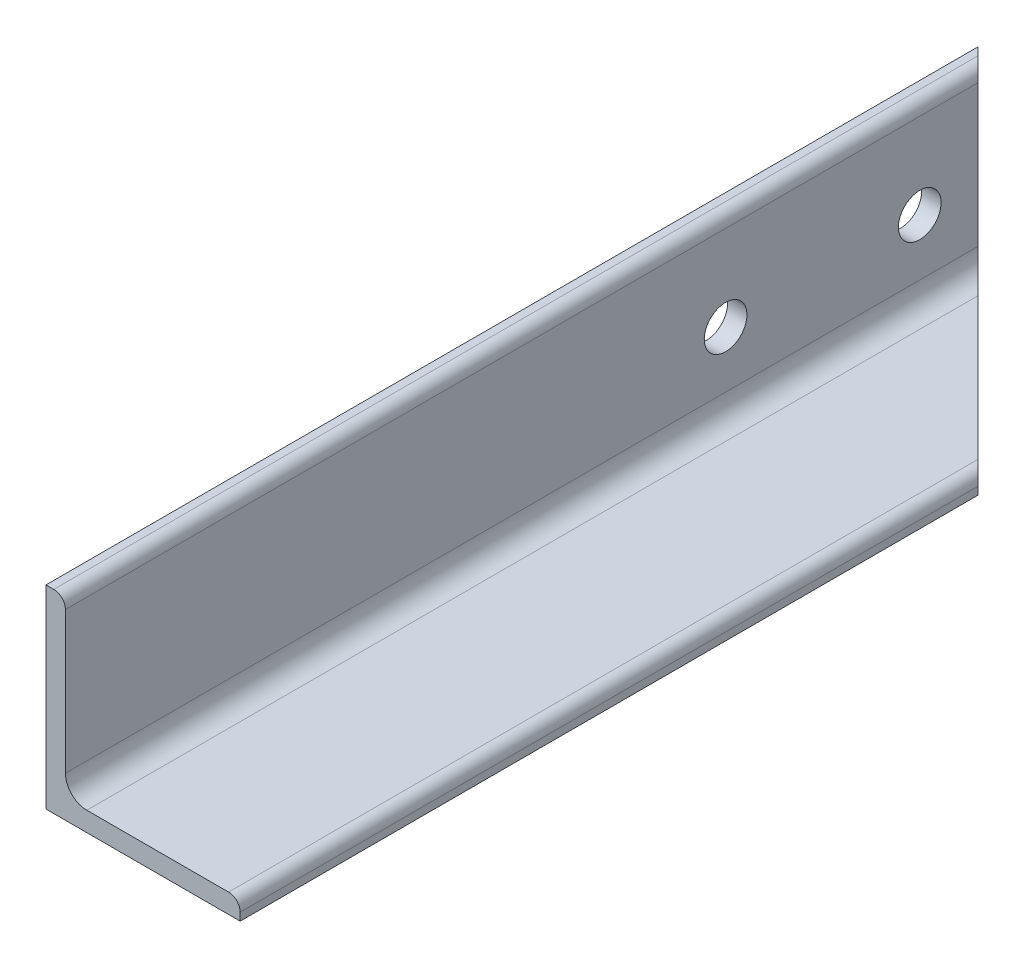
ISO-10303-21;
HEADER;
FILE_DESCRIPTION(('STEP AP214'),'2;1');
FILE_NAME('part.step','',(''),(''),'','','');
FILE_SCHEMA(('AUTOMOTIVE_DESIGN { 1 0 10303 214 1 1 1 1 }'));
ENDSEC;
DATA;
#1=APPLICATION_CONTEXT('core data for automotive mechanical design processes');
#2=APPLICATION_PROTOCOL_DEFINITION('international standard','automotive_design',2000,#1);
#3=PRODUCT_CONTEXT('',#1,'mechanical');
#4=PRODUCT('Part','Part','',(#3));
#5=PRODUCT_RELATED_PRODUCT_CATEGORY('part','',(#4));
#6=PRODUCT_DEFINITION_FORMATION('','',#4);
#7=PRODUCT_DEFINITION_CONTEXT('part definition',#1,'design');
#8=PRODUCT_DEFINITION('design','',#6,#7);
#9=PRODUCT_DEFINITION_SHAPE('','',#8);
#10=(LENGTH_UNIT() NAMED_UNIT(*) SI_UNIT(.MILLI.,.METRE.));
#11=(NAMED_UNIT(*) PLANE_ANGLE_UNIT() SI_UNIT($,.RADIAN.));
#12=(NAMED_UNIT(*) SI_UNIT($,.STERADIAN.) SOLID_ANGLE_UNIT());
#13=UNCERTAINTY_MEASURE_WITH_UNIT(LENGTH_MEASURE(1.E-05),#10,'distance_accuracy_value','');
#14=(GEOMETRIC_REPRESENTATION_CONTEXT(3) GLOBAL_UNCERTAINTY_ASSIGNED_CONTEXT((#13)) GLOBAL_UNIT_ASSIGNED_CONTEXT((#10,
#11,#12)) REPRESENTATION_CONTEXT('',''));
#15=CARTESIAN_POINT('',(0.,0.,0.));
#16=DIRECTION('',(0.,0.,1.));
#17=DIRECTION('',(1.,0.,0.));
#18=AXIS2_PLACEMENT_3D('',#15,#16,#17);
#19=CARTESIAN_POINT('',(1.99999999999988,49.9999999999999,240.));
#20=DIRECTION('',(0.,-1.,0.));
#21=DIRECTION('',(0.,0.,-1.));
#22=AXIS2_PLACEMENT_3D('',#19,#20,#21);
#23=PLANE('',#22);
#24=DIRECTION('',(0.,0.,-1.));
#25=VECTOR('',#24,1.);
#26=CARTESIAN_POINT('',(1.99999999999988,49.9999999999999,240.));
#27=LINE('',#26,#25);
#28=CARTESIAN_POINT('',(1.99999999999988,49.9999999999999,240.));
#29=VERTEX_POINT('',#28);
#30=CARTESIAN_POINT('',(1.99999999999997,50.,2.));
#31=VERTEX_POINT('',#30);
#32=EDGE_CURVE('E173',#29,#31,#27,.T.);
#33=ORIENTED_EDGE('',*,*,#32,.T.);
#34=DIRECTION('',(-0.707106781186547,0.,-0.707106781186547));
#35=VECTOR('',#34,1.);
#36=CARTESIAN_POINT('',(121.,49.9999999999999,121.));
#37=LINE('',#36,#35);
#38=CARTESIAN_POINT('',(0.,50.,0.));
#39=VERTEX_POINT('',#38);
#40=EDGE_CURVE('E195',#31,#39,#37,.T.);
#41=ORIENTED_EDGE('',*,*,#40,.T.);
#42=DIRECTION('',(0.,0.,-1.));
#43=VECTOR('',#42,1.);
#44=CARTESIAN_POINT('',(-1.00613961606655E-13,49.9999999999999,240.));
#45=LINE('',#44,#43);
#46=CARTESIAN_POINT('',(-1.00613961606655E-13,49.9999999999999,240.));
#47=VERTEX_POINT('',#46);
#48=EDGE_CURVE('E11',#47,#39,#45,.T.);
#49=ORIENTED_EDGE('',*,*,#48,.F.);
#50=DIRECTION('',(-1.,0.,0.));
#51=VECTOR('',#50,1.);
#52=CARTESIAN_POINT('',(1.99999999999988,49.9999999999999,240.));
#53=LINE('',#52,#51);
#54=EDGE_CURVE('E148',#29,#47,#53,.T.);
#55=ORIENTED_EDGE('',*,*,#54,.F.);
#56=EDGE_LOOP('',(#33,#41,#49,#55));
#57=FACE_BOUND('',#56,.T.);
#58=ADVANCED_FACE('F41',(#57),#23,.F.);
#59=CARTESIAN_POINT('',(-1.00613961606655E-13,49.9999999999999,240.));
#60=DIRECTION('',(1.,0.,0.));
#61=DIRECTION('',(0.,1.,0.));
#62=AXIS2_PLACEMENT_3D('',#59,#60,#61);
#63=PLANE('',#62);
#64=CARTESIAN_POINT('',(0.,24.9999999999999,70.0000000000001));
#65=DIRECTION('',(-1.,0.,0.));
#66=DIRECTION('',(0.,-1.,0.));
#67=AXIS2_PLACEMENT_3D('',#64,#65,#66);
#68=CIRCLE('',#67,5.5);
#69=CARTESIAN_POINT('',(0.,19.4999999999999,70.0000000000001));
#70=VERTEX_POINT('',#69);
#71=EDGE_CURVE('E155',#70,#70,#68,.T.);
#72=ORIENTED_EDGE('',*,*,#71,.F.);
#73=EDGE_LOOP('',(#72));
#74=FACE_BOUND('',#73,.T.);
#75=CARTESIAN_POINT('',(0.,24.9999999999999,20.));
#76=DIRECTION('',(-1.,0.,0.));
#77=DIRECTION('',(0.,-1.,0.));
#78=AXIS2_PLACEMENT_3D('',#75,#76,#77);
#79=CIRCLE('',#78,5.5);
#80=CARTESIAN_POINT('',(0.,19.4999999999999,20.));
#81=VERTEX_POINT('',#80);
#82=EDGE_CURVE('E145',#81,#81,#79,.T.);
#83=ORIENTED_EDGE('',*,*,#82,.F.);
#84=EDGE_LOOP('',(#83));
#85=FACE_BOUND('',#84,.T.);
#86=DIRECTION('',(0.,-1.,0.));
#87=VECTOR('',#86,1.);
#88=CARTESIAN_POINT('',(0.,50.,0.));
#89=LINE('',#88,#87);
#90=CARTESIAN_POINT('',(0.,0.,0.));
#91=VERTEX_POINT('',#90);
#92=EDGE_CURVE('E144',#39,#91,#89,.T.);
#93=ORIENTED_EDGE('',*,*,#92,.T.);
#94=DIRECTION('',(0.,0.,-1.));
#95=VECTOR('',#94,1.);
#96=CARTESIAN_POINT('',(0.,-1.11022302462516E-13,240.));
#97=LINE('',#96,#95);
#98=CARTESIAN_POINT('',(0.,-1.11022302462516E-13,240.));
#99=VERTEX_POINT('',#98);
#100=EDGE_CURVE('E49',#99,#91,#97,.T.);
#101=ORIENTED_EDGE('',*,*,#100,.F.);
#102=DIRECTION('',(0.,-1.,0.));
#103=VECTOR('',#102,1.);
#104=CARTESIAN_POINT('',(-1.00613961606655E-13,49.9999999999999,240.));
#105=LINE('',#104,#103);
#106=EDGE_CURVE('E160',#47,#99,#105,.T.);
#107=ORIENTED_EDGE('',*,*,#106,.F.);
#108=ORIENTED_EDGE('',*,*,#48,.T.);
#109=EDGE_LOOP('',(#93,#101,#107,#108));
#110=FACE_BOUND('',#109,.T.);
#111=ADVANCED_FACE('F214',(#74,#85,#110),#63,.F.);
#112=CARTESIAN_POINT('',(0.,-1.11022302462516E-13,240.));
#113=DIRECTION('',(0.,1.,0.));
#114=DIRECTION('',(0.,0.,1.));
#115=AXIS2_PLACEMENT_3D('',#112,#113,#114);
#116=PLANE('',#115);
#117=ORIENTED_EDGE('',*,*,#100,.T.);
#118=DIRECTION('',(-0.707106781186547,0.,-0.707106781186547));
#119=VECTOR('',#118,1.);
#120=CARTESIAN_POINT('',(49.9999999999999,0.,50.));
#121=LINE('',#120,#119);
#122=CARTESIAN_POINT('',(49.9999999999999,0.,50.));
#123=VERTEX_POINT('',#122);
#124=EDGE_CURVE('E115',#123,#91,#121,.T.);
#125=ORIENTED_EDGE('',*,*,#124,.F.);
#126=DIRECTION('',(0.,0.,-1.));
#127=VECTOR('',#126,1.);
#128=CARTESIAN_POINT('',(49.9999999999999,-1.11022302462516E-13,240.));
#129=LINE('',#128,#127);
#130=CARTESIAN_POINT('',(49.9999999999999,-1.11022302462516E-13,240.));
#131=VERTEX_POINT('',#130);
#132=EDGE_CURVE('E130',#131,#123,#129,.T.);
#133=ORIENTED_EDGE('',*,*,#132,.F.);
#134=DIRECTION('',(1.,0.,0.));
#135=VECTOR('',#134,1.);
#136=CARTESIAN_POINT('',(0.,-1.11022302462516E-13,240.));
#137=LINE('',#136,#135);
#138=EDGE_CURVE('E162',#99,#131,#137,.T.);
#139=ORIENTED_EDGE('',*,*,#138,.F.);
#140=EDGE_LOOP('',(#117,#125,#133,#139));
#141=FACE_BOUND('',#140,.T.);
#142=ADVANCED_FACE('F128',(#141),#116,.F.);
#143=CARTESIAN_POINT('',(49.9999999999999,-1.11022302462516E-13,240.));
#144=DIRECTION('',(-1.,0.,0.));
#145=DIRECTION('',(0.,0.,1.));
#146=AXIS2_PLACEMENT_3D('',#143,#144,#145);
#147=PLANE('',#146);
#148=ORIENTED_EDGE('',*,*,#132,.T.);
#149=DIRECTION('',(0.,-1.,0.));
#150=VECTOR('',#149,1.);
#151=CARTESIAN_POINT('',(49.9999999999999,240.,49.9999999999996));
#152=LINE('',#151,#150);
#153=CARTESIAN_POINT('',(49.9999999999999,1.99999999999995,50.));
#154=VERTEX_POINT('',#153);
#155=EDGE_CURVE('E112',#154,#123,#152,.T.);
#156=ORIENTED_EDGE('',*,*,#155,.F.);
#157=DIRECTION('',(0.,0.,-1.));
#158=VECTOR('',#157,1.);
#159=CARTESIAN_POINT('',(49.9999999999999,1.99999999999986,240.));
#160=LINE('',#159,#158);
#161=CARTESIAN_POINT('',(49.9999999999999,1.99999999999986,240.));
#162=VERTEX_POINT('',#161);
#163=EDGE_CURVE('E136',#162,#154,#160,.T.);
#164=ORIENTED_EDGE('',*,*,#163,.F.);
#165=DIRECTION('',(0.,1.,0.));
#166=VECTOR('',#165,1.);
#167=CARTESIAN_POINT('',(49.9999999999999,-1.11022302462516E-13,240.));
#168=LINE('',#167,#166);
#169=EDGE_CURVE('E135',#131,#162,#168,.T.);
#170=ORIENTED_EDGE('',*,*,#169,.F.);
#171=EDGE_LOOP('',(#148,#156,#164,#170));
#172=FACE_BOUND('',#171,.T.);
#173=ADVANCED_FACE('F134',(#172),#147,.F.);
#174=CARTESIAN_POINT('',(46.9999999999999,1.99999999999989,240.));
#175=DIRECTION('',(0.,0.,-1.));
#176=DIRECTION('',(-1.,0.,0.));
#177=AXIS2_PLACEMENT_3D('',#174,#175,#176);
#178=CYLINDRICAL_SURFACE('',#177,3.);
#179=ORIENTED_EDGE('',*,*,#163,.T.);
#180=CARTESIAN_POINT('',(47.,1.99999999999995,46.9999999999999));
#181=DIRECTION('',(-0.707106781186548,0.,0.707106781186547));
#182=DIRECTION('',(-0.707106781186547,0.,-0.707106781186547));
#183=AXIS2_PLACEMENT_3D('',#180,#181,#182);
#184=ELLIPSE('',#183,4.24264068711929,3.);
#185=CARTESIAN_POINT('',(47.,4.99999999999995,46.9999999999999));
#186=VERTEX_POINT('',#185);
#187=EDGE_CURVE('E118',#154,#186,#184,.T.);
#188=ORIENTED_EDGE('',*,*,#187,.T.);
#189=DIRECTION('',(0.,0.,-1.));
#190=VECTOR('',#189,1.);
#191=CARTESIAN_POINT('',(46.9999999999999,4.99999999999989,240.));
#192=LINE('',#191,#190);
#193=CARTESIAN_POINT('',(46.9999999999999,4.99999999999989,240.));
#194=VERTEX_POINT('',#193);
#195=EDGE_CURVE('E139',#194,#186,#192,.T.);
#196=ORIENTED_EDGE('',*,*,#195,.F.);
#197=CARTESIAN_POINT('',(46.9999999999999,1.99999999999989,240.));
#198=DIRECTION('',(0.,0.,1.));
#199=DIRECTION('',(1.,0.,0.));
#200=AXIS2_PLACEMENT_3D('',#197,#198,#199);
#201=CIRCLE('',#200,3.);
#202=EDGE_CURVE('E165',#162,#194,#201,.T.);
#203=ORIENTED_EDGE('',*,*,#202,.F.);
#204=EDGE_LOOP('',(#179,#188,#196,#203));
#205=FACE_BOUND('',#204,.T.);
#206=ADVANCED_FACE('F194',(#205),#178,.T.);
#207=CARTESIAN_POINT('',(46.9999999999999,4.99999999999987,240.));
#208=DIRECTION('',(0.,-1.,0.));
#209=DIRECTION('',(1.,0.,0.));
#210=AXIS2_PLACEMENT_3D('',#207,#208,#209);
#211=PLANE('',#210);
#212=ORIENTED_EDGE('',*,*,#195,.T.);
#213=DIRECTION('',(-0.707106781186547,0.,-0.707106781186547));
#214=VECTOR('',#213,1.);
#215=CARTESIAN_POINT('',(143.5,4.99999999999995,143.5));
#216=LINE('',#215,#214);
#217=CARTESIAN_POINT('',(10.5,5.,10.5));
#218=VERTEX_POINT('',#217);
#219=EDGE_CURVE('E191',#186,#218,#216,.T.);
#220=ORIENTED_EDGE('',*,*,#219,.T.);
#221=DIRECTION('',(0.,0.,-1.));
#222=VECTOR('',#221,1.);
#223=CARTESIAN_POINT('',(10.5,4.99999999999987,240.));
#224=LINE('',#223,#222);
#225=CARTESIAN_POINT('',(10.5,4.99999999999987,240.));
#226=VERTEX_POINT('',#225);
#227=EDGE_CURVE('E182',#226,#218,#224,.T.);
#228=ORIENTED_EDGE('',*,*,#227,.F.);
#229=DIRECTION('',(-1.,0.,0.));
#230=VECTOR('',#229,1.);
#231=CARTESIAN_POINT('',(46.9999999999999,4.99999999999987,240.));
#232=LINE('',#231,#230);
#233=EDGE_CURVE('E167',#194,#226,#232,.T.);
#234=ORIENTED_EDGE('',*,*,#233,.F.);
#235=EDGE_LOOP('',(#212,#220,#228,#234));
#236=FACE_BOUND('',#235,.T.);
#237=ADVANCED_FACE('F189',(#236),#211,.F.);
#238=CARTESIAN_POINT('',(10.4999999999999,10.4999999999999,240.));
#239=DIRECTION('',(0.,0.,-1.));
#240=DIRECTION('',(-1.,0.,0.));
#241=AXIS2_PLACEMENT_3D('',#238,#239,#240);
#242=CYLINDRICAL_SURFACE('',#241,5.5);
#243=ORIENTED_EDGE('',*,*,#227,.T.);
#244=CARTESIAN_POINT('',(10.5,10.5,10.5));
#245=DIRECTION('',(-0.707106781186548,0.,0.707106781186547));
#246=DIRECTION('',(-0.707106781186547,0.,-0.707106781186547));
#247=AXIS2_PLACEMENT_3D('',#244,#245,#246);
#248=ELLIPSE('',#247,7.77817459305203,5.5);
#249=CARTESIAN_POINT('',(5.,10.5,4.99999999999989));
#250=VERTEX_POINT('',#249);
#251=EDGE_CURVE('E198',#218,#250,#248,.F.);
#252=ORIENTED_EDGE('',*,*,#251,.T.);
#253=DIRECTION('',(0.,0.,-1.));
#254=VECTOR('',#253,1.);
#255=CARTESIAN_POINT('',(4.99999999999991,10.4999999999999,240.));
#256=LINE('',#255,#254);
#257=CARTESIAN_POINT('',(4.99999999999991,10.4999999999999,240.));
#258=VERTEX_POINT('',#257);
#259=EDGE_CURVE('E179',#258,#250,#256,.T.);
#260=ORIENTED_EDGE('',*,*,#259,.F.);
#261=CARTESIAN_POINT('',(10.4999999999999,10.4999999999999,240.));
#262=DIRECTION('',(0.,0.,-1.));
#263=DIRECTION('',(-1.,0.,0.));
#264=AXIS2_PLACEMENT_3D('',#261,#262,#263);
#265=CIRCLE('',#264,5.5);
#266=EDGE_CURVE('E169',#226,#258,#265,.T.);
#267=ORIENTED_EDGE('',*,*,#266,.F.);
#268=EDGE_LOOP('',(#243,#252,#260,#267));
#269=FACE_BOUND('',#268,.T.);
#270=ADVANCED_FACE('F231',(#269),#242,.F.);
#271=CARTESIAN_POINT('',(4.99999999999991,10.4999999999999,240.));
#272=DIRECTION('',(-1.,0.,0.));
#273=DIRECTION('',(0.,-1.,0.));
#274=AXIS2_PLACEMENT_3D('',#271,#272,#273);
#275=PLANE('',#274);
#276=CARTESIAN_POINT('',(4.99999999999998,24.9999999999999,70.0000000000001));
#277=DIRECTION('',(-1.,0.,0.));
#278=DIRECTION('',(0.,-1.,0.));
#279=AXIS2_PLACEMENT_3D('',#276,#277,#278);
#280=CIRCLE('',#279,5.5);
#281=CARTESIAN_POINT('',(4.99999999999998,19.4999999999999,70.0000000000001));
#282=VERTEX_POINT('',#281);
#283=EDGE_CURVE('E44',#282,#282,#280,.T.);
#284=ORIENTED_EDGE('',*,*,#283,.T.);
#285=EDGE_LOOP('',(#284));
#286=FACE_BOUND('',#285,.T.);
#287=CARTESIAN_POINT('',(4.99999999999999,24.9999999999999,20.));
#288=DIRECTION('',(-1.,0.,0.));
#289=DIRECTION('',(0.,-1.,0.));
#290=AXIS2_PLACEMENT_3D('',#287,#288,#289);
#291=CIRCLE('',#290,5.5);
#292=CARTESIAN_POINT('',(4.99999999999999,19.4999999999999,20.));
#293=VERTEX_POINT('',#292);
#294=EDGE_CURVE('E142',#293,#293,#291,.T.);
#295=ORIENTED_EDGE('',*,*,#294,.T.);
#296=EDGE_LOOP('',(#295));
#297=FACE_BOUND('',#296,.T.);
#298=ORIENTED_EDGE('',*,*,#259,.T.);
#299=DIRECTION('',(0.,1.,0.));
#300=VECTOR('',#299,1.);
#301=CARTESIAN_POINT('',(5.,10.5,4.99999999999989));
#302=LINE('',#301,#300);
#303=CARTESIAN_POINT('',(4.99999999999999,47.,4.99999999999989));
#304=VERTEX_POINT('',#303);
#305=EDGE_CURVE('E203',#250,#304,#302,.T.);
#306=ORIENTED_EDGE('',*,*,#305,.T.);
#307=DIRECTION('',(0.,0.,-1.));
#308=VECTOR('',#307,1.);
#309=CARTESIAN_POINT('',(4.99999999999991,46.9999999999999,240.));
#310=LINE('',#309,#308);
#311=CARTESIAN_POINT('',(4.99999999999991,46.9999999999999,240.));
#312=VERTEX_POINT('',#311);
#313=EDGE_CURVE('E176',#312,#304,#310,.T.);
#314=ORIENTED_EDGE('',*,*,#313,.F.);
#315=DIRECTION('',(0.,1.,0.));
#316=VECTOR('',#315,1.);
#317=CARTESIAN_POINT('',(4.99999999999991,10.4999999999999,240.));
#318=LINE('',#317,#316);
#319=EDGE_CURVE('E62',#258,#312,#318,.T.);
#320=ORIENTED_EDGE('',*,*,#319,.F.);
#321=EDGE_LOOP('',(#298,#306,#314,#320));
#322=FACE_BOUND('',#321,.T.);
#323=ADVANCED_FACE('F234',(#286,#297,#322),#275,.F.);
#324=CARTESIAN_POINT('',(1.9999999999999,46.9999999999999,240.));
#325=DIRECTION('',(0.,0.,-1.));
#326=DIRECTION('',(-1.,0.,0.));
#327=AXIS2_PLACEMENT_3D('',#324,#325,#326);
#328=CYLINDRICAL_SURFACE('',#327,3.);
#329=ORIENTED_EDGE('',*,*,#313,.T.);
#330=CARTESIAN_POINT('',(1.99999999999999,47.,2.));
#331=DIRECTION('',(-0.707106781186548,0.,0.707106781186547));
#332=DIRECTION('',(-0.707106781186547,0.,-0.707106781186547));
#333=AXIS2_PLACEMENT_3D('',#330,#331,#332);
#334=ELLIPSE('',#333,4.24264068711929,3.);
#335=EDGE_CURVE('E123',#304,#31,#334,.T.);
#336=ORIENTED_EDGE('',*,*,#335,.T.);
#337=ORIENTED_EDGE('',*,*,#32,.F.);
#338=CARTESIAN_POINT('',(1.9999999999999,46.9999999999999,240.));
#339=DIRECTION('',(0.,0.,1.));
#340=DIRECTION('',(1.,0.,0.));
#341=AXIS2_PLACEMENT_3D('',#338,#339,#340);
#342=CIRCLE('',#341,3.);
#343=EDGE_CURVE('E57',#312,#29,#342,.T.);
#344=ORIENTED_EDGE('',*,*,#343,.F.);
#345=EDGE_LOOP('',(#329,#336,#337,#344));
#346=FACE_BOUND('',#345,.T.);
#347=ADVANCED_FACE('F208',(#346),#328,.T.);
#348=CARTESIAN_POINT('',(46.9999999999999,1.99999999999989,240.));
#349=DIRECTION('',(0.,0.,1.));
#350=DIRECTION('',(1.,0.,0.));
#351=AXIS2_PLACEMENT_3D('',#348,#349,#350);
#352=PLANE('',#351);
#353=ORIENTED_EDGE('',*,*,#54,.T.);
#354=ORIENTED_EDGE('',*,*,#106,.T.);
#355=ORIENTED_EDGE('',*,*,#138,.T.);
#356=ORIENTED_EDGE('',*,*,#169,.T.);
#357=ORIENTED_EDGE('',*,*,#202,.T.);
#358=ORIENTED_EDGE('',*,*,#233,.T.);
#359=ORIENTED_EDGE('',*,*,#266,.T.);
#360=ORIENTED_EDGE('',*,*,#319,.T.);
#361=ORIENTED_EDGE('',*,*,#343,.T.);
#362=EDGE_LOOP('',(#353,#354,#355,#356,#357,#358,#359,#360,#361));
#363=FACE_BOUND('',#362,.T.);
#364=ADVANCED_FACE('F212',(#363),#352,.T.);
#365=CARTESIAN_POINT('',(240.,24.9999999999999,19.9999999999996));
#366=DIRECTION('',(-1.,0.,0.));
#367=DIRECTION('',(0.,-1.,0.));
#368=AXIS2_PLACEMENT_3D('',#365,#366,#367);
#369=CYLINDRICAL_SURFACE('',#368,5.5);
#370=ORIENTED_EDGE('',*,*,#82,.T.);
#371=EDGE_LOOP('',(#370));
#372=FACE_BOUND('',#371,.T.);
#373=ORIENTED_EDGE('',*,*,#294,.F.);
#374=EDGE_LOOP('',(#373));
#375=FACE_BOUND('',#374,.T.);
#376=ADVANCED_FACE('F243',(#372,#375),#369,.F.);
#377=CARTESIAN_POINT('',(240.,24.9999999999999,69.9999999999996));
#378=DIRECTION('',(-1.,0.,0.));
#379=DIRECTION('',(0.,-1.,0.));
#380=AXIS2_PLACEMENT_3D('',#377,#378,#379);
#381=CYLINDRICAL_SURFACE('',#380,5.5);
#382=ORIENTED_EDGE('',*,*,#71,.T.);
#383=EDGE_LOOP('',(#382));
#384=FACE_BOUND('',#383,.T.);
#385=ORIENTED_EDGE('',*,*,#283,.F.);
#386=EDGE_LOOP('',(#385));
#387=FACE_BOUND('',#386,.T.);
#388=ADVANCED_FACE('F246',(#384,#387),#381,.F.);
#389=CARTESIAN_POINT('',(49.9999999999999,240.,49.9999999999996));
#390=DIRECTION('',(-0.707106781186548,0.,0.707106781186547));
#391=DIRECTION('',(0.707106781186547,0.,0.707106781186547));
#392=AXIS2_PLACEMENT_3D('',#389,#390,#391);
#393=PLANE('',#392);
#394=ORIENTED_EDGE('',*,*,#335,.F.);
#395=ORIENTED_EDGE('',*,*,#305,.F.);
#396=ORIENTED_EDGE('',*,*,#251,.F.);
#397=ORIENTED_EDGE('',*,*,#219,.F.);
#398=ORIENTED_EDGE('',*,*,#187,.F.);
#399=ORIENTED_EDGE('',*,*,#155,.T.);
#400=ORIENTED_EDGE('',*,*,#124,.T.);
#401=ORIENTED_EDGE('',*,*,#92,.F.);
#402=ORIENTED_EDGE('',*,*,#40,.F.);
#403=EDGE_LOOP('',(#394,#395,#396,#397,#398,#399,#400,#401,#402));
#404=FACE_BOUND('',#403,.T.);
#405=ADVANCED_FACE('F114',(#404),#393,.F.);
#406=CLOSED_SHELL('',(#58,#111,#142,#173,#206,#237,#270,#323,#347,#364,#376,#388,#405));
#407=MANIFOLD_SOLID_BREP('B2',#406);
#408=ADVANCED_BREP_SHAPE_REPRESENTATION('',(#18,#407),#14);
#409=SHAPE_DEFINITION_REPRESENTATION(#9,#408);
ENDSEC;
END-ISO-10303-21;
